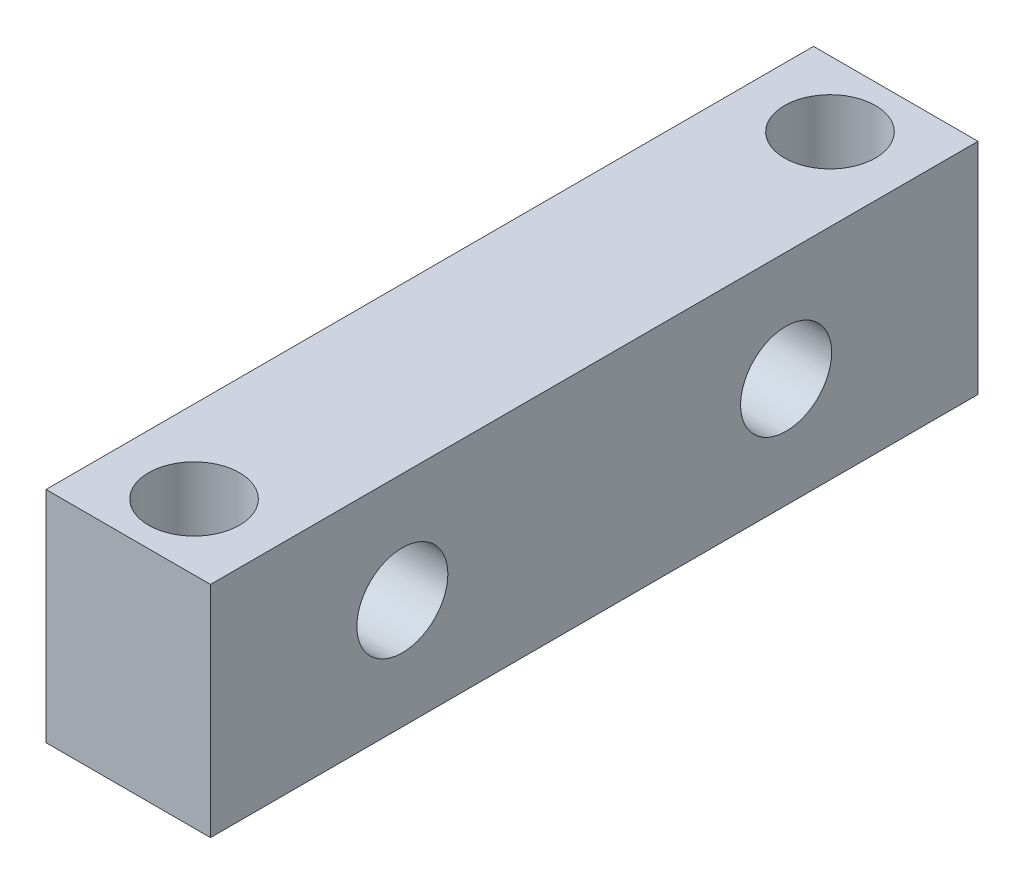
from build123d import *

# Parameters (mm, degrees)
ESQUISSE1_W             = 70
ESQUISSE1_H             = 20
BOSS_EXTRU_1_DEPTH      = 15
ESQUISSE2_R             = 4.15
ENL_V_MAT_EXTRU_1_DEPTH = 75.330343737
ESQUISSE3_R             = 4.15
ENL_V_MAT_EXTRU_2_DEPTH = 75.330343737


with BuildPart() as part:
    # Esquisse1 → Boss.-Extru.1 (new body)
    with BuildSketch(Plane(origin=(0, 0, 0), x_dir=(0, 0, -1), z_dir=(1, 0, 0))):
        with Locations((35, 10)):
            Rectangle(ESQUISSE1_W, ESQUISSE1_H)
    extrude(amount=BOSS_EXTRU_1_DEPTH)

    # Esquisse2 → Enl_v. mat.-Extru.1 (cut, through all)
    with BuildSketch(Plane(origin=(15, 0, 0), x_dir=(0, 0, -1), z_dir=(1, 0, 0))):
        with Locations((17.5, 10)):
            Circle(ESQUISSE2_R)
        with Locations((52.5, 10)):
            Circle(ESQUISSE2_R)
    extrude(amount=-ENL_V_MAT_EXTRU_1_DEPTH, mode=Mode.SUBTRACT)

    # Esquisse3 → Enl_v. mat.-Extru.2 (cut, through all)
    with BuildSketch(Plane(origin=(0, 20, 0), x_dir=(1, 0, 0), z_dir=(0, 1, 0))):
        with Locations(Location((7.5, 6, 0), (0, 0, 270))):
            Circle(ESQUISSE3_R)
        with Locations(Location((7.5, 64, 0), (0, 0, 270))):
            Circle(ESQUISSE3_R)
    extrude(amount=-ENL_V_MAT_EXTRU_2_DEPTH, mode=Mode.SUBTRACT)


solid = part.part
